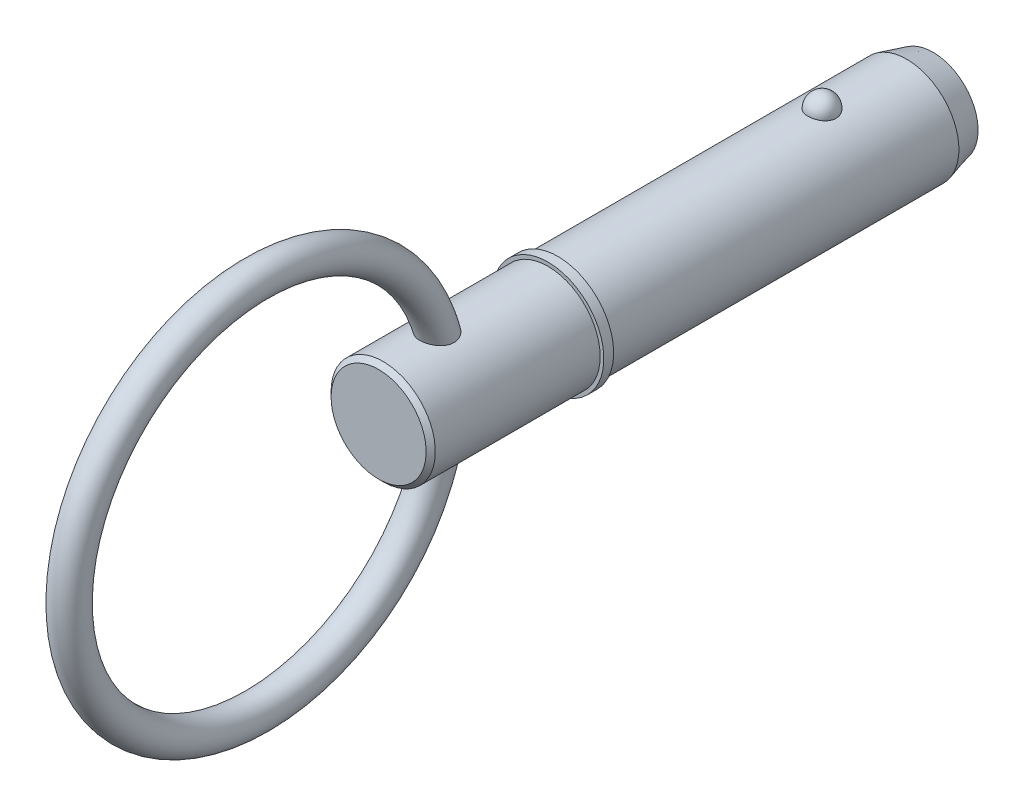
from build123d import *

# Parameters (mm, degrees)
SKETCH2_R           = 7.94
BOSS_EXTRUDE1_DEPTH = 38.1
BOSS_EXTRUDE2_START = 19.05
SKETCH3_R           = 7.94
BOSS_EXTRUDE2_DEPTH = 19.05
CHAMFER1_SIZE       = 4
CHAMFER1_SIZE2      = 1.07179677
SKETCH20_W          = 1.5
SKETCH20_H          = 8.5
SKETCH21_R          = 7.94
BOSS_EXTRUDE3_DEPTH = 27.31
CHAMFER2_SIZE       = 0.7
SKETCH24_R          = 2.5


with BuildPart() as part:
    # Sketch2 → Boss-Extrude1 (new body)
    with BuildSketch(Plane.XY):
        with Locations(Location((0, 0, 0), (0, 0, 180))):
            Circle(SKETCH2_R)
    extrude(amount=BOSS_EXTRUDE1_DEPTH)

    # Sketch3 → Boss-Extrude2 (add)
    with BuildSketch(Plane(origin=(0, 0, 0), x_dir=(-1, 0, 0), z_dir=(0, 0, -1)).offset(BOSS_EXTRUDE2_START)):
        Circle(SKETCH3_R)
    extrude(amount=-BOSS_EXTRUDE2_DEPTH)

    # Chamfer1
    chamfer1_edges = [part.edges().sort_by_distance(p)[0] for p in [
        (7.94, 0, -19.05),
    ]]
    chamfer1_side = [part.faces().sort_by_distance(p)[0] for p in [
        (7.94, 0, 9.525),
    ]]
    chamfer(chamfer1_edges, length=CHAMFER1_SIZE, length2=CHAMFER1_SIZE2, reference=chamfer1_side[0])

    # Sketch18 → Revolve1 (revolve)
    with BuildSketch(Plane(origin=(0, 0, 0), x_dir=(0, 0, -1), z_dir=(1, 0, 0))):
        with BuildLine():
            Line((2.15, 10.09), (2.15, 5.79))
            ThreePointArc((2.15, 5.79), (0, 7.94), (2.15, 10.09))
        make_face()
    revolve(axis=Axis((0, 10.09, -2.15), (0, -1, 0)))

    # Sketch20 → Revolve2 (revolve)
    with BuildSketch(Plane(origin=(0, 0, 0), x_dir=(0, 0, -1), z_dir=(1, 0, 0)), mode=Mode.PRIVATE) as revolve2_sk:
        with Locations((-38.85, 4.25)):
            Rectangle(SKETCH20_W, SKETCH20_H)
    revolve(revolve2_sk.sketch.rotate(Axis((0, 0, 33.728787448), (0, 0, 1)), 90), axis=Axis((0, 0, 33.728787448), (0, 0, 1)))

    # Sketch21 → Boss-Extrude3 (add)
    with BuildSketch(Plane(origin=(0, 0, 38.1), x_dir=(-1, 0, 0), z_dir=(0, 0, -1))):
        Circle(SKETCH21_R)
    extrude(amount=-BOSS_EXTRUDE3_DEPTH)

    # Chamfer2
    chamfer2_edges = [part.edges().sort_by_distance(p)[0] for p in [
        (7.94, 0, 65.41),
    ]]
    chamfer(chamfer2_edges, length=CHAMFER2_SIZE)

    # Sweep1: sweep along a path in Sketch23
    with BuildLine(Plane(origin=(0, 0, 0), x_dir=(0, 0, -1), z_dir=(1, 0, 0))) as sweep1_path:
        CenterArc((-83.985, 0), 28.575, 0, 360)
    # Sketch24 → Sweep1 (sweep)
    with BuildSketch(Plane(origin=(0, 0, 0), x_dir=(1, 0, 0), z_dir=(0, 1, 0))):
        with Locations((0, -55.41)):
            Circle(SKETCH24_R)
    sweep(path=sweep1_path.line)


solid = part.part
